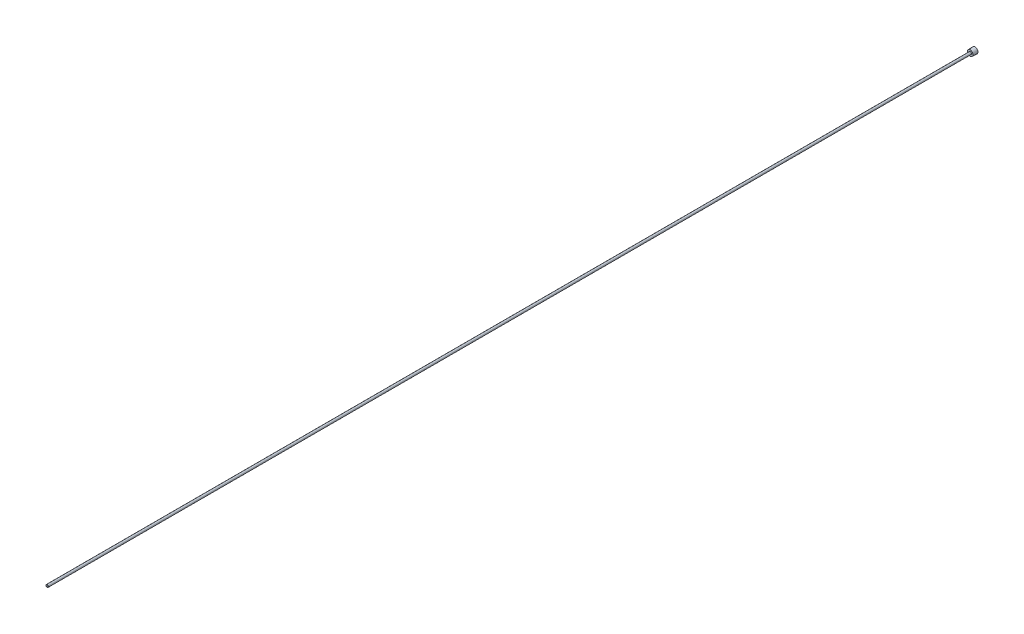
from build123d import *

# Parameters (mm, degrees)
SKETCH2_R          = 1.3843
CUT_EXTRUDE1_DEPTH = 1220.212468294
CUT_EXTRUDE2_DEPTH = 3.96875


with BuildPart() as part:
    # Sketch1 → Revolve1 (revolve)
    with BuildSketch(Plane(origin=(0, 0, 0), x_dir=(0, 0, -1), z_dir=(1, 0, 0)), mode=Mode.PRIVATE) as revolve1_sk:
        Polygon((-1219.2, 0), (0, 0), (0, 3.8989), (-6.35, 3.667387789), (-6.35, 1.5875), (-1219.2, 1.5875), align=None)
    revolve(revolve1_sk.sketch.rotate(Axis((0, 0, 0), (0, 0, -1)), 90), axis=Axis((0, 0, 0), (0, 0, -1)))

    # Sketch2 → Cut-Extrude1 (cut, through all)
    with BuildSketch(Plane.XY.offset(1219.2)):
        Circle(SKETCH2_R)
    extrude(amount=-CUT_EXTRUDE1_DEPTH, mode=Mode.SUBTRACT)

    # Sketch3 → Cut-Extrude2 (cut)
    with BuildSketch(Plane(origin=(0, 0, 0), x_dir=(-1, 0, 0), z_dir=(0, 0, -1))):
        Polygon((2.38125, -1.374815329), (2.38125, 1.374815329), (0, 2.749630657), (-2.38125, 1.374815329), (-2.38125, -1.374815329), (0, -2.749630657), align=None)
    extrude(amount=-CUT_EXTRUDE2_DEPTH, mode=Mode.SUBTRACT)


solid = part.part
